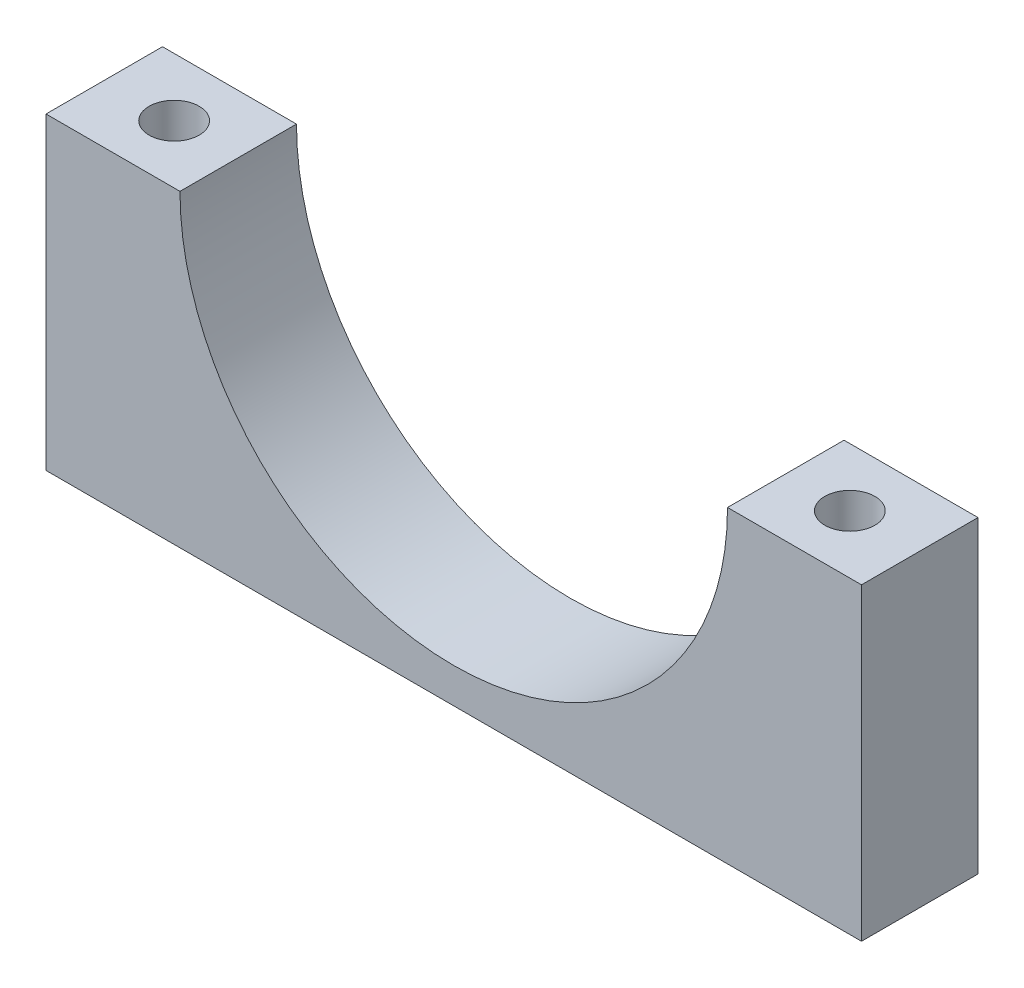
from build123d import *

# Parameters (mm, degrees)
EXTRUSION1_DEPTH                                   = 10
CHAMBRAGE_POUR_VIS_T_TE_HEXAGONALE_M52_D           = 4.3
CHAMBRAGE_POUR_VIS_T_TE_HEXAGONALE_M52_CBORE_D     = 8
CHAMBRAGE_POUR_VIS_T_TE_HEXAGONALE_M52_CBORE_DEPTH = 4
R_P_TITION_LIN_AIRE1_COUNT                         = 2
R_P_TITION_LIN_AIRE1_PITCH                         = 58


with BuildPart() as part:
    # Esquisse1 → Extrusion1 (new body)
    with BuildSketch(Plane.XY):
        with BuildLine():
            Line((-50.5, -25), (-39, -25))
            Line((-39, -25), (-39, -51.5))
            Line((-39, -51.5), (-109, -51.5))
            Line((-109, -51.5), (-109, -25))
            Line((-109, -25), (-97.5, -25))
            ThreePointArc((-97.5, -25), (-74, -48.5), (-50.5, -25))
        make_face()
    extrude(amount=-EXTRUSION1_DEPTH)

    # Chambrage pour vis _ t_te hexagonale M52 (through all)
    with Locations(Plane.XZ.offset(51.5)):
        with Locations((-103, -5)):
            chambrage_pour_vis_t_te_hexagonale_m52 = CounterBoreHole(CHAMBRAGE_POUR_VIS_T_TE_HEXAGONALE_M52_D / 2, CHAMBRAGE_POUR_VIS_T_TE_HEXAGONALE_M52_CBORE_D / 2, CHAMBRAGE_POUR_VIS_T_TE_HEXAGONALE_M52_CBORE_DEPTH)

    # R_p_tition lin_aire1: Chambrage pour vis _ t_te hexagonale M52 ×2
    with Locations(*[(i * R_P_TITION_LIN_AIRE1_PITCH, 0, 0) for i in range(1, R_P_TITION_LIN_AIRE1_COUNT)]):
        add(chambrage_pour_vis_t_te_hexagonale_m52, mode=Mode.SUBTRACT)


solid = part.part
